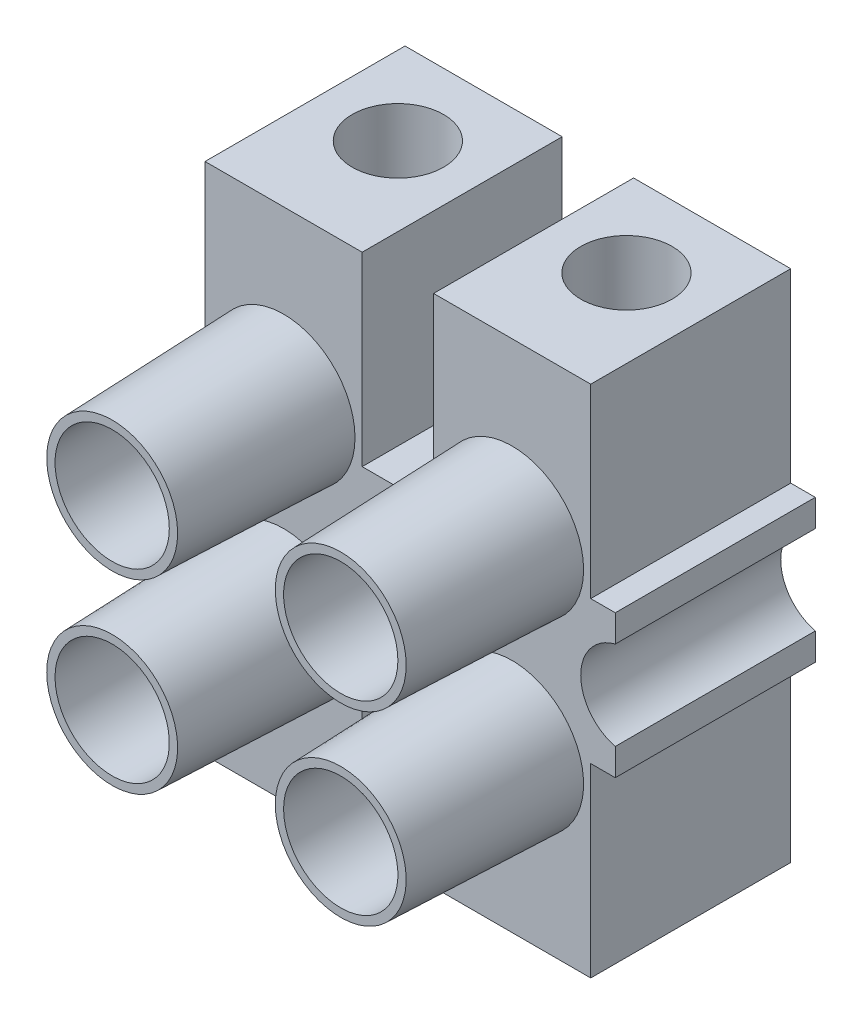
from build123d import *

# Parameters (mm, degrees)
ESQUISSE1_R             = 1.6
BASE_EXTRUSION_DEPTH    = 7
ESQUISSE2_R             = 2.5
ESQUISSE2_R_2           = 2
BOSS_EXTRU_1_DEPTH      = 6
ESQUISSE3_R             = 1.6
ENL_V_MAT_EXTRU_1_DEPTH = 27.441929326
D_POUILLE1_ANGLE        = 2


with BuildPart() as part:
    # Esquisse1 → Base-Extrusion (new body)
    with BuildSketch(Plane.XY):
        with BuildLine():
            Line((0, 2.5), (0, 9))
            Line((0, 9), (5.5, 9))
            Line((5.5, 9), (5.5, 2.5))
            Line((5.5, 2.5), (8, 2.5))
            Line((8, 2.5), (8, 9))
            Line((8, 9), (13.5, 9))
            Line((13.5, 9), (13.5, 2.5))
            Line((13.5, 2.5), (14.358817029, 2.5))
            Line((14.358817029, 2.5), (14.358817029, 1.551443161))
            ThreePointArc((14.358817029, 1.551443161), (13.15, 0), (14.358817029, -1.551443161))
            Line((14.358817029, -1.551443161), (14.358817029, -2.5))
            Line((14.358817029, -2.5), (13.5, -2.5))
            Line((13.5, -2.5), (13.5, -9))
            Line((13.5, -9), (8, -9))
            Line((8, -9), (8, -2.5))
            Line((8, -2.5), (5.5, -2.5))
            Line((5.5, -2.5), (5.5, -9))
            Line((5.5, -9), (0, -9))
            Line((0, -9), (0, -2.5))
            Line((0, -2.5), (0, 2.5))
        make_face()
        with Locations((6.75, 0)):
            Circle(ESQUISSE1_R, mode=Mode.SUBTRACT)
    extrude(amount=BASE_EXTRUSION_DEPTH)

    # Esquisse2 → Boss.-Extru.1 (add)
    # profile 1 of 7: a face of its own
    with BuildSketch(Plane.XY.offset(7)):
        with Locations((2.75, 3.25)):
            Circle(ESQUISSE2_R)
        with Locations((2.75, 3.25)):
            Circle(ESQUISSE2_R_2, mode=Mode.SUBTRACT)
    # profile 2 of 7: a face of its own
    with BuildSketch(Plane.XY.offset(7)):
        with Locations((10.75, 3.25)):
            Circle(ESQUISSE2_R)
        with Locations((10.75, 3.25)):
            Circle(ESQUISSE2_R_2, mode=Mode.SUBTRACT)
    # profile 3 of 7: a face of its own
    with BuildSketch(Plane.XY.offset(7)):
        with Locations(Location((10.75, -3.25, 0), (0, 0, 180))):
            Circle(ESQUISSE2_R)
        with Locations(Location((10.75, -3.25, 0), (0, 0, 180))):
            Circle(ESQUISSE2_R_2, mode=Mode.SUBTRACT)
    # profile 4 of 7: a face of its own
    with BuildSketch(Plane.XY.offset(7)):
        with Locations(Location((2.75, -3.25, 0), (0, 0, 180))):
            Circle(ESQUISSE2_R)
        with Locations(Location((2.75, -3.25, 0), (0, 0, 180))):
            Circle(ESQUISSE2_R_2, mode=Mode.SUBTRACT)
    # profile 5 of 7: a face of its own
    with BuildSketch(Plane.XY.offset(7)):
        with Locations((34.75, 3.25)):
            Circle(ESQUISSE2_R)
        with Locations((34.75, 3.25)):
            Circle(ESQUISSE2_R_2, mode=Mode.SUBTRACT)
    # profile 6 of 7: a face of its own
    with BuildSketch(Plane.XY.offset(7)):
        with Locations((26.75, 3.25)):
            Circle(ESQUISSE2_R)
        with Locations((26.75, 3.25)):
            Circle(ESQUISSE2_R_2, mode=Mode.SUBTRACT)
    # profile 7 of 7: a face of its own
    with BuildSketch(Plane.XY.offset(7)):
        with Locations((18.75, 3.25)):
            Circle(ESQUISSE2_R)
        with Locations((18.75, 3.25)):
            Circle(ESQUISSE2_R_2, mode=Mode.SUBTRACT)
    extrude(amount=BOSS_EXTRU_1_DEPTH)


with BuildPart() as boss_extru_1_kept_piece:
    # of the separate pieces the step leaves, the one the design keeps (boss_extru_1_pieces_kept)
    add(part.part.solids().sort_by_distance((0, 9, 0))[0])

    # Esquisse3 → Enl_v. mat.-Extru.1 (cut, through all)
    with BuildSketch(Plane.XZ.offset(9)):
        with Locations(Location((2.75, 3, 0), (0, 0, 270))):
            Circle(ESQUISSE3_R)
        with Locations(Location((10.75, 3, 0), (0, 0, 270))):
            Circle(ESQUISSE3_R)
        with Locations((18.75, 3)):
            Circle(ESQUISSE3_R)
        with Locations((26.75, 3)):
            Circle(ESQUISSE3_R)
        with Locations((34.75, 3)):
            Circle(ESQUISSE3_R)
    extrude(amount=-ENL_V_MAT_EXTRU_1_DEPTH, mode=Mode.SUBTRACT)

    # D_pouille1
    d_pouille1_faces = [boss_extru_1_kept_piece.faces().sort_by_distance(p)[0] for p in [
        (0.25, 3.25, 10),
        (5.25, -3.25, 10),
        (8.25, 3.25, 10),
        (13.25, -3.25, 10),
    ]]
    draft(d_pouille1_faces, Plane(origin=(14.75, 0, 7), x_dir=(1, 0, 0), z_dir=(0, 0, 1)), D_POUILLE1_ANGLE)


solid = boss_extru_1_kept_piece.part
